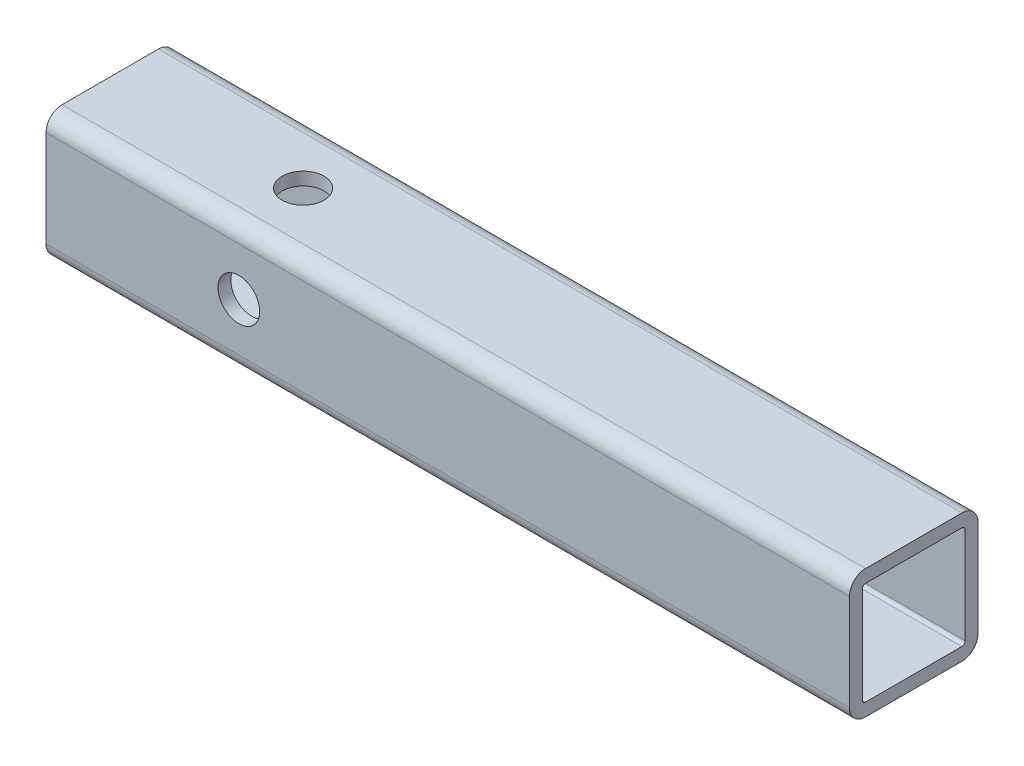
ISO-10303-21;
HEADER;
FILE_DESCRIPTION(('STEP AP214'),'2;1');
FILE_NAME('part.step','',(''),(''),'','','');
FILE_SCHEMA(('AUTOMOTIVE_DESIGN { 1 0 10303 214 1 1 1 1 }'));
ENDSEC;
DATA;
#1=APPLICATION_CONTEXT('core data for automotive mechanical design processes');
#2=APPLICATION_PROTOCOL_DEFINITION('international standard','automotive_design',2000,#1);
#3=PRODUCT_CONTEXT('',#1,'mechanical');
#4=PRODUCT('Part','Part','',(#3));
#5=PRODUCT_RELATED_PRODUCT_CATEGORY('part','',(#4));
#6=PRODUCT_DEFINITION_FORMATION('','',#4);
#7=PRODUCT_DEFINITION_CONTEXT('part definition',#1,'design');
#8=PRODUCT_DEFINITION('design','',#6,#7);
#9=PRODUCT_DEFINITION_SHAPE('','',#8);
#10=(LENGTH_UNIT() NAMED_UNIT(*) SI_UNIT(.MILLI.,.METRE.));
#11=(NAMED_UNIT(*) PLANE_ANGLE_UNIT() SI_UNIT($,.RADIAN.));
#12=(NAMED_UNIT(*) SI_UNIT($,.STERADIAN.) SOLID_ANGLE_UNIT());
#13=UNCERTAINTY_MEASURE_WITH_UNIT(LENGTH_MEASURE(1.E-05),#10,'distance_accuracy_value','');
#14=(GEOMETRIC_REPRESENTATION_CONTEXT(3) GLOBAL_UNCERTAINTY_ASSIGNED_CONTEXT((#13)) GLOBAL_UNIT_ASSIGNED_CONTEXT((#10,
#11,#12)) REPRESENTATION_CONTEXT('',''));
#15=CARTESIAN_POINT('',(0.,0.,0.));
#16=DIRECTION('',(0.,0.,1.));
#17=DIRECTION('',(1.,0.,0.));
#18=AXIS2_PLACEMENT_3D('',#15,#16,#17);
#19=CARTESIAN_POINT('',(250.,-5.,5.));
#20=DIRECTION('',(1.,0.,0.));
#21=DIRECTION('',(0.,0.,-1.));
#22=AXIS2_PLACEMENT_3D('',#19,#20,#21);
#23=PLANE('',#22);
#24=CARTESIAN_POINT('',(250.,-5.,5.));
#25=DIRECTION('',(1.,0.,0.));
#26=DIRECTION('',(0.,0.,-1.));
#27=AXIS2_PLACEMENT_3D('',#24,#25,#26);
#28=CIRCLE('',#27,5.);
#29=CARTESIAN_POINT('',(250.,-5.00000000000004,0.));
#30=VERTEX_POINT('',#29);
#31=CARTESIAN_POINT('',(250.,0.,5.00000000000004));
#32=VERTEX_POINT('',#31);
#33=EDGE_CURVE('E227',#30,#32,#28,.T.);
#34=ORIENTED_EDGE('',*,*,#33,.T.);
#35=DIRECTION('',(0.,0.,1.));
#36=VECTOR('',#35,1.);
#37=CARTESIAN_POINT('',(250.,0.,5.00000000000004));
#38=LINE('',#37,#36);
#39=CARTESIAN_POINT('',(250.,0.,35.));
#40=VERTEX_POINT('',#39);
#41=EDGE_CURVE('E230',#32,#40,#38,.T.);
#42=ORIENTED_EDGE('',*,*,#41,.T.);
#43=CARTESIAN_POINT('',(250.,-5.,35.));
#44=DIRECTION('',(1.,0.,0.));
#45=DIRECTION('',(0.,0.,-1.));
#46=AXIS2_PLACEMENT_3D('',#43,#44,#45);
#47=CIRCLE('',#46,5.);
#48=CARTESIAN_POINT('',(250.,-5.00000000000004,40.));
#49=VERTEX_POINT('',#48);
#50=EDGE_CURVE('E232',#40,#49,#47,.T.);
#51=ORIENTED_EDGE('',*,*,#50,.T.);
#52=DIRECTION('',(0.,-1.,0.));
#53=VECTOR('',#52,1.);
#54=CARTESIAN_POINT('',(250.,-5.00000000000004,40.));
#55=LINE('',#54,#53);
#56=CARTESIAN_POINT('',(250.,-35.,40.));
#57=VERTEX_POINT('',#56);
#58=EDGE_CURVE('E234',#49,#57,#55,.T.);
#59=ORIENTED_EDGE('',*,*,#58,.T.);
#60=CARTESIAN_POINT('',(250.,-35.,35.));
#61=DIRECTION('',(1.,0.,0.));
#62=DIRECTION('',(0.,0.,-1.));
#63=AXIS2_PLACEMENT_3D('',#60,#61,#62);
#64=CIRCLE('',#63,5.);
#65=CARTESIAN_POINT('',(250.,-40.,35.));
#66=VERTEX_POINT('',#65);
#67=EDGE_CURVE('E236',#57,#66,#64,.T.);
#68=ORIENTED_EDGE('',*,*,#67,.T.);
#69=DIRECTION('',(0.,0.,-1.));
#70=VECTOR('',#69,1.);
#71=CARTESIAN_POINT('',(250.,-40.,5.00000000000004));
#72=LINE('',#71,#70);
#73=CARTESIAN_POINT('',(250.,-40.,5.00000000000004));
#74=VERTEX_POINT('',#73);
#75=EDGE_CURVE('E238',#66,#74,#72,.T.);
#76=ORIENTED_EDGE('',*,*,#75,.T.);
#77=CARTESIAN_POINT('',(250.,-35.,5.));
#78=DIRECTION('',(1.,0.,0.));
#79=DIRECTION('',(0.,0.,-1.));
#80=AXIS2_PLACEMENT_3D('',#77,#78,#79);
#81=CIRCLE('',#80,5.);
#82=CARTESIAN_POINT('',(250.,-35.,0.));
#83=VERTEX_POINT('',#82);
#84=EDGE_CURVE('E240',#74,#83,#81,.T.);
#85=ORIENTED_EDGE('',*,*,#84,.T.);
#86=DIRECTION('',(0.,1.,0.));
#87=VECTOR('',#86,1.);
#88=CARTESIAN_POINT('',(250.,-5.00000000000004,0.));
#89=LINE('',#88,#87);
#90=EDGE_CURVE('E242',#83,#30,#89,.T.);
#91=ORIENTED_EDGE('',*,*,#90,.T.);
#92=EDGE_LOOP('',(#34,#42,#51,#59,#68,#76,#85,#91));
#93=FACE_BOUND('',#92,.T.);
#94=DIRECTION('',(0.,0.,1.));
#95=VECTOR('',#94,1.);
#96=CARTESIAN_POINT('',(250.,-4.,5.00000000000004));
#97=LINE('',#96,#95);
#98=CARTESIAN_POINT('',(250.,-4.,5.00000000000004));
#99=VERTEX_POINT('',#98);
#100=CARTESIAN_POINT('',(250.,-4.,35.));
#101=VERTEX_POINT('',#100);
#102=EDGE_CURVE('E185',#99,#101,#97,.T.);
#103=ORIENTED_EDGE('',*,*,#102,.F.);
#104=CARTESIAN_POINT('',(250.,-5.,5.));
#105=DIRECTION('',(1.,0.,0.));
#106=DIRECTION('',(0.,0.,-1.));
#107=AXIS2_PLACEMENT_3D('',#104,#105,#106);
#108=CIRCLE('',#107,0.999999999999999);
#109=CARTESIAN_POINT('',(250.,-5.00000000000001,4.));
#110=VERTEX_POINT('',#109);
#111=EDGE_CURVE('E157',#110,#99,#108,.T.);
#112=ORIENTED_EDGE('',*,*,#111,.F.);
#113=DIRECTION('',(0.,1.,0.));
#114=VECTOR('',#113,1.);
#115=CARTESIAN_POINT('',(250.,-5.00000000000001,4.));
#116=LINE('',#115,#114);
#117=CARTESIAN_POINT('',(250.,-35.,4.));
#118=VERTEX_POINT('',#117);
#119=EDGE_CURVE('E197',#118,#110,#116,.T.);
#120=ORIENTED_EDGE('',*,*,#119,.F.);
#121=CARTESIAN_POINT('',(250.,-35.,5.));
#122=DIRECTION('',(1.,0.,0.));
#123=DIRECTION('',(0.,0.,-1.));
#124=AXIS2_PLACEMENT_3D('',#121,#122,#123);
#125=CIRCLE('',#124,1.);
#126=CARTESIAN_POINT('',(250.,-36.,5.00000000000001));
#127=VERTEX_POINT('',#126);
#128=EDGE_CURVE('E195',#127,#118,#125,.T.);
#129=ORIENTED_EDGE('',*,*,#128,.F.);
#130=DIRECTION('',(0.,0.,-1.));
#131=VECTOR('',#130,1.);
#132=CARTESIAN_POINT('',(250.,-36.,5.00000000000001));
#133=LINE('',#132,#131);
#134=CARTESIAN_POINT('',(250.,-36.,35.));
#135=VERTEX_POINT('',#134);
#136=EDGE_CURVE('E193',#135,#127,#133,.T.);
#137=ORIENTED_EDGE('',*,*,#136,.F.);
#138=CARTESIAN_POINT('',(250.,-35.,35.));
#139=DIRECTION('',(1.,0.,0.));
#140=DIRECTION('',(0.,0.,-1.));
#141=AXIS2_PLACEMENT_3D('',#138,#139,#140);
#142=CIRCLE('',#141,1.);
#143=CARTESIAN_POINT('',(250.,-35.,36.));
#144=VERTEX_POINT('',#143);
#145=EDGE_CURVE('E191',#144,#135,#142,.T.);
#146=ORIENTED_EDGE('',*,*,#145,.F.);
#147=DIRECTION('',(0.,-1.,0.));
#148=VECTOR('',#147,1.);
#149=CARTESIAN_POINT('',(250.,-5.00000000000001,36.));
#150=LINE('',#149,#148);
#151=CARTESIAN_POINT('',(250.,-5.00000000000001,36.));
#152=VERTEX_POINT('',#151);
#153=EDGE_CURVE('E189',#152,#144,#150,.T.);
#154=ORIENTED_EDGE('',*,*,#153,.F.);
#155=CARTESIAN_POINT('',(250.,-5.,35.));
#156=DIRECTION('',(1.,0.,0.));
#157=DIRECTION('',(0.,0.,-1.));
#158=AXIS2_PLACEMENT_3D('',#155,#156,#157);
#159=CIRCLE('',#158,1.);
#160=EDGE_CURVE('E187',#101,#152,#159,.T.);
#161=ORIENTED_EDGE('',*,*,#160,.F.);
#162=EDGE_LOOP('',(#103,#112,#120,#129,#137,#146,#154,#161));
#163=FACE_BOUND('',#162,.T.);
#164=ADVANCED_FACE('F27',(#93,#163),#23,.T.);
#165=CARTESIAN_POINT('',(0.,-5.,5.));
#166=DIRECTION('',(1.,0.,0.));
#167=DIRECTION('',(0.,0.,-1.));
#168=AXIS2_PLACEMENT_3D('',#165,#166,#167);
#169=PLANE('',#168);
#170=CARTESIAN_POINT('',(0.,-5.,5.));
#171=DIRECTION('',(1.,0.,0.));
#172=DIRECTION('',(0.,0.,-1.));
#173=AXIS2_PLACEMENT_3D('',#170,#171,#172);
#174=CIRCLE('',#173,5.);
#175=CARTESIAN_POINT('',(0.,-5.00000000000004,0.));
#176=VERTEX_POINT('',#175);
#177=CARTESIAN_POINT('',(0.,0.,5.00000000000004));
#178=VERTEX_POINT('',#177);
#179=EDGE_CURVE('E158',#176,#178,#174,.T.);
#180=ORIENTED_EDGE('',*,*,#179,.F.);
#181=DIRECTION('',(0.,1.,0.));
#182=VECTOR('',#181,1.);
#183=CARTESIAN_POINT('',(0.,-5.00000000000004,0.));
#184=LINE('',#183,#182);
#185=CARTESIAN_POINT('',(0.,-35.,0.));
#186=VERTEX_POINT('',#185);
#187=EDGE_CURVE('E225',#186,#176,#184,.T.);
#188=ORIENTED_EDGE('',*,*,#187,.F.);
#189=CARTESIAN_POINT('',(0.,-35.,5.));
#190=DIRECTION('',(1.,0.,0.));
#191=DIRECTION('',(0.,0.,-1.));
#192=AXIS2_PLACEMENT_3D('',#189,#190,#191);
#193=CIRCLE('',#192,5.);
#194=CARTESIAN_POINT('',(0.,-40.,5.00000000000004));
#195=VERTEX_POINT('',#194);
#196=EDGE_CURVE('E223',#195,#186,#193,.T.);
#197=ORIENTED_EDGE('',*,*,#196,.F.);
#198=DIRECTION('',(0.,0.,-1.));
#199=VECTOR('',#198,1.);
#200=CARTESIAN_POINT('',(0.,-40.,5.00000000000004));
#201=LINE('',#200,#199);
#202=CARTESIAN_POINT('',(0.,-40.,35.));
#203=VERTEX_POINT('',#202);
#204=EDGE_CURVE('E221',#203,#195,#201,.T.);
#205=ORIENTED_EDGE('',*,*,#204,.F.);
#206=CARTESIAN_POINT('',(0.,-35.,35.));
#207=DIRECTION('',(1.,0.,0.));
#208=DIRECTION('',(0.,0.,-1.));
#209=AXIS2_PLACEMENT_3D('',#206,#207,#208);
#210=CIRCLE('',#209,5.);
#211=CARTESIAN_POINT('',(0.,-35.,40.));
#212=VERTEX_POINT('',#211);
#213=EDGE_CURVE('E219',#212,#203,#210,.T.);
#214=ORIENTED_EDGE('',*,*,#213,.F.);
#215=DIRECTION('',(0.,-1.,0.));
#216=VECTOR('',#215,1.);
#217=CARTESIAN_POINT('',(0.,-5.00000000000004,40.));
#218=LINE('',#217,#216);
#219=CARTESIAN_POINT('',(0.,-5.00000000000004,40.));
#220=VERTEX_POINT('',#219);
#221=EDGE_CURVE('E217',#220,#212,#218,.T.);
#222=ORIENTED_EDGE('',*,*,#221,.F.);
#223=CARTESIAN_POINT('',(0.,-5.,35.));
#224=DIRECTION('',(1.,0.,0.));
#225=DIRECTION('',(0.,0.,-1.));
#226=AXIS2_PLACEMENT_3D('',#223,#224,#225);
#227=CIRCLE('',#226,5.);
#228=CARTESIAN_POINT('',(0.,0.,35.));
#229=VERTEX_POINT('',#228);
#230=EDGE_CURVE('E215',#229,#220,#227,.T.);
#231=ORIENTED_EDGE('',*,*,#230,.F.);
#232=DIRECTION('',(0.,0.,1.));
#233=VECTOR('',#232,1.);
#234=CARTESIAN_POINT('',(0.,0.,5.00000000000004));
#235=LINE('',#234,#233);
#236=EDGE_CURVE('E213',#178,#229,#235,.T.);
#237=ORIENTED_EDGE('',*,*,#236,.F.);
#238=EDGE_LOOP('',(#180,#188,#197,#205,#214,#222,#231,#237));
#239=FACE_BOUND('',#238,.T.);
#240=CARTESIAN_POINT('',(0.,-5.,5.));
#241=DIRECTION('',(1.,0.,0.));
#242=DIRECTION('',(0.,0.,-1.));
#243=AXIS2_PLACEMENT_3D('',#240,#241,#242);
#244=CIRCLE('',#243,0.999999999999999);
#245=CARTESIAN_POINT('',(0.,-5.00000000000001,4.));
#246=VERTEX_POINT('',#245);
#247=CARTESIAN_POINT('',(0.,-4.,5.00000000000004));
#248=VERTEX_POINT('',#247);
#249=EDGE_CURVE('E52',#246,#248,#244,.T.);
#250=ORIENTED_EDGE('',*,*,#249,.T.);
#251=DIRECTION('',(0.,0.,1.));
#252=VECTOR('',#251,1.);
#253=CARTESIAN_POINT('',(0.,-4.,5.00000000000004));
#254=LINE('',#253,#252);
#255=CARTESIAN_POINT('',(0.,-4.,35.));
#256=VERTEX_POINT('',#255);
#257=EDGE_CURVE('E144',#248,#256,#254,.T.);
#258=ORIENTED_EDGE('',*,*,#257,.T.);
#259=CARTESIAN_POINT('',(0.,-5.,35.));
#260=DIRECTION('',(1.,0.,0.));
#261=DIRECTION('',(0.,0.,-1.));
#262=AXIS2_PLACEMENT_3D('',#259,#260,#261);
#263=CIRCLE('',#262,1.);
#264=CARTESIAN_POINT('',(0.,-5.00000000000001,36.));
#265=VERTEX_POINT('',#264);
#266=EDGE_CURVE('E153',#256,#265,#263,.T.);
#267=ORIENTED_EDGE('',*,*,#266,.T.);
#268=DIRECTION('',(0.,-1.,0.));
#269=VECTOR('',#268,1.);
#270=CARTESIAN_POINT('',(0.,-5.00000000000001,36.));
#271=LINE('',#270,#269);
#272=CARTESIAN_POINT('',(0.,-35.,36.));
#273=VERTEX_POINT('',#272);
#274=EDGE_CURVE('E172',#265,#273,#271,.T.);
#275=ORIENTED_EDGE('',*,*,#274,.T.);
#276=CARTESIAN_POINT('',(0.,-35.,35.));
#277=DIRECTION('',(1.,0.,0.));
#278=DIRECTION('',(0.,0.,-1.));
#279=AXIS2_PLACEMENT_3D('',#276,#277,#278);
#280=CIRCLE('',#279,1.);
#281=CARTESIAN_POINT('',(0.,-36.,35.));
#282=VERTEX_POINT('',#281);
#283=EDGE_CURVE('E175',#273,#282,#280,.T.);
#284=ORIENTED_EDGE('',*,*,#283,.T.);
#285=DIRECTION('',(0.,0.,-1.));
#286=VECTOR('',#285,1.);
#287=CARTESIAN_POINT('',(0.,-36.,5.00000000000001));
#288=LINE('',#287,#286);
#289=CARTESIAN_POINT('',(0.,-36.,5.00000000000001));
#290=VERTEX_POINT('',#289);
#291=EDGE_CURVE('E178',#282,#290,#288,.T.);
#292=ORIENTED_EDGE('',*,*,#291,.T.);
#293=CARTESIAN_POINT('',(0.,-35.,5.));
#294=DIRECTION('',(1.,0.,0.));
#295=DIRECTION('',(0.,0.,-1.));
#296=AXIS2_PLACEMENT_3D('',#293,#294,#295);
#297=CIRCLE('',#296,1.);
#298=CARTESIAN_POINT('',(0.,-35.,4.));
#299=VERTEX_POINT('',#298);
#300=EDGE_CURVE('E181',#290,#299,#297,.T.);
#301=ORIENTED_EDGE('',*,*,#300,.T.);
#302=DIRECTION('',(0.,1.,0.));
#303=VECTOR('',#302,1.);
#304=CARTESIAN_POINT('',(0.,-5.00000000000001,4.));
#305=LINE('',#304,#303);
#306=EDGE_CURVE('E163',#299,#246,#305,.T.);
#307=ORIENTED_EDGE('',*,*,#306,.T.);
#308=EDGE_LOOP('',(#250,#258,#267,#275,#284,#292,#301,#307));
#309=FACE_BOUND('',#308,.T.);
#310=ADVANCED_FACE('F161',(#239,#309),#169,.F.);
#311=CARTESIAN_POINT('',(250.,-5.,5.));
#312=DIRECTION('',(-1.,0.,0.));
#313=DIRECTION('',(0.,0.,1.));
#314=AXIS2_PLACEMENT_3D('',#311,#312,#313);
#315=CYLINDRICAL_SURFACE('',#314,5.);
#316=ORIENTED_EDGE('',*,*,#179,.T.);
#317=DIRECTION('',(-1.,0.,0.));
#318=VECTOR('',#317,1.);
#319=CARTESIAN_POINT('',(250.,0.,5.00000000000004));
#320=LINE('',#319,#318);
#321=EDGE_CURVE('E11',#32,#178,#320,.T.);
#322=ORIENTED_EDGE('',*,*,#321,.F.);
#323=ORIENTED_EDGE('',*,*,#33,.F.);
#324=DIRECTION('',(-1.,0.,0.));
#325=VECTOR('',#324,1.);
#326=CARTESIAN_POINT('',(250.,-5.00000000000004,0.));
#327=LINE('',#326,#325);
#328=EDGE_CURVE('E244',#30,#176,#327,.T.);
#329=ORIENTED_EDGE('',*,*,#328,.T.);
#330=EDGE_LOOP('',(#316,#322,#323,#329));
#331=FACE_BOUND('',#330,.T.);
#332=ADVANCED_FACE('F29',(#331),#315,.T.);
#333=CARTESIAN_POINT('',(250.,0.,5.00000000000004));
#334=DIRECTION('',(0.,-1.,0.));
#335=DIRECTION('',(0.,0.,-1.));
#336=AXIS2_PLACEMENT_3D('',#333,#334,#335);
#337=PLANE('',#336);
#338=CARTESIAN_POINT('',(60.,0.,20.));
#339=DIRECTION('',(0.,-1.,0.));
#340=DIRECTION('',(0.,0.,-1.));
#341=AXIS2_PLACEMENT_3D('',#338,#339,#340);
#342=CIRCLE('',#341,6.5);
#343=CARTESIAN_POINT('',(60.,0.,13.5));
#344=VERTEX_POINT('',#343);
#345=EDGE_CURVE('E277',#344,#344,#342,.T.);
#346=ORIENTED_EDGE('',*,*,#345,.T.);
#347=EDGE_LOOP('',(#346));
#348=FACE_BOUND('',#347,.T.);
#349=ORIENTED_EDGE('',*,*,#236,.T.);
#350=DIRECTION('',(-1.,0.,0.));
#351=VECTOR('',#350,1.);
#352=CARTESIAN_POINT('',(250.,0.,35.));
#353=LINE('',#352,#351);
#354=EDGE_CURVE('E36',#40,#229,#353,.T.);
#355=ORIENTED_EDGE('',*,*,#354,.F.);
#356=ORIENTED_EDGE('',*,*,#41,.F.);
#357=ORIENTED_EDGE('',*,*,#321,.T.);
#358=EDGE_LOOP('',(#349,#355,#356,#357));
#359=FACE_BOUND('',#358,.T.);
#360=ADVANCED_FACE('F327',(#348,#359),#337,.F.);
#361=CARTESIAN_POINT('',(250.,-5.,35.));
#362=DIRECTION('',(-1.,0.,0.));
#363=DIRECTION('',(0.,0.,1.));
#364=AXIS2_PLACEMENT_3D('',#361,#362,#363);
#365=CYLINDRICAL_SURFACE('',#364,5.);
#366=ORIENTED_EDGE('',*,*,#230,.T.);
#367=DIRECTION('',(-1.,0.,0.));
#368=VECTOR('',#367,1.);
#369=CARTESIAN_POINT('',(250.,-5.00000000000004,40.));
#370=LINE('',#369,#368);
#371=EDGE_CURVE('E259',#49,#220,#370,.T.);
#372=ORIENTED_EDGE('',*,*,#371,.F.);
#373=ORIENTED_EDGE('',*,*,#50,.F.);
#374=ORIENTED_EDGE('',*,*,#354,.T.);
#375=EDGE_LOOP('',(#366,#372,#373,#374));
#376=FACE_BOUND('',#375,.T.);
#377=ADVANCED_FACE('F325',(#376),#365,.T.);
#378=CARTESIAN_POINT('',(250.,-5.00000000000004,40.));
#379=DIRECTION('',(0.,0.,-1.));
#380=DIRECTION('',(-1.,0.,0.));
#381=AXIS2_PLACEMENT_3D('',#378,#379,#380);
#382=PLANE('',#381);
#383=CARTESIAN_POINT('',(60.,-20.,40.));
#384=DIRECTION('',(0.,0.,1.));
#385=DIRECTION('',(1.,0.,0.));
#386=AXIS2_PLACEMENT_3D('',#383,#384,#385);
#387=CIRCLE('',#386,6.5);
#388=CARTESIAN_POINT('',(66.5,-20.,40.));
#389=VERTEX_POINT('',#388);
#390=EDGE_CURVE('E268',#389,#389,#387,.T.);
#391=ORIENTED_EDGE('',*,*,#390,.F.);
#392=EDGE_LOOP('',(#391));
#393=FACE_BOUND('',#392,.T.);
#394=ORIENTED_EDGE('',*,*,#221,.T.);
#395=DIRECTION('',(-1.,0.,0.));
#396=VECTOR('',#395,1.);
#397=CARTESIAN_POINT('',(250.,-35.,40.));
#398=LINE('',#397,#396);
#399=EDGE_CURVE('E256',#57,#212,#398,.T.);
#400=ORIENTED_EDGE('',*,*,#399,.F.);
#401=ORIENTED_EDGE('',*,*,#58,.F.);
#402=ORIENTED_EDGE('',*,*,#371,.T.);
#403=EDGE_LOOP('',(#394,#400,#401,#402));
#404=FACE_BOUND('',#403,.T.);
#405=ADVANCED_FACE('F321',(#393,#404),#382,.F.);
#406=CARTESIAN_POINT('',(250.,-35.,35.));
#407=DIRECTION('',(-1.,0.,0.));
#408=DIRECTION('',(0.,0.,1.));
#409=AXIS2_PLACEMENT_3D('',#406,#407,#408);
#410=CYLINDRICAL_SURFACE('',#409,5.);
#411=ORIENTED_EDGE('',*,*,#213,.T.);
#412=DIRECTION('',(-1.,0.,0.));
#413=VECTOR('',#412,1.);
#414=CARTESIAN_POINT('',(250.,-40.,35.));
#415=LINE('',#414,#413);
#416=EDGE_CURVE('E253',#66,#203,#415,.T.);
#417=ORIENTED_EDGE('',*,*,#416,.F.);
#418=ORIENTED_EDGE('',*,*,#67,.F.);
#419=ORIENTED_EDGE('',*,*,#399,.T.);
#420=EDGE_LOOP('',(#411,#417,#418,#419));
#421=FACE_BOUND('',#420,.T.);
#422=ADVANCED_FACE('F290',(#421),#410,.T.);
#423=CARTESIAN_POINT('',(250.,-40.,5.00000000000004));
#424=DIRECTION('',(0.,1.,0.));
#425=DIRECTION('',(0.,0.,1.));
#426=AXIS2_PLACEMENT_3D('',#423,#424,#425);
#427=PLANE('',#426);
#428=CARTESIAN_POINT('',(60.,-40.,20.));
#429=DIRECTION('',(0.,-1.,0.));
#430=DIRECTION('',(0.,0.,-1.));
#431=AXIS2_PLACEMENT_3D('',#428,#429,#430);
#432=CIRCLE('',#431,6.5);
#433=CARTESIAN_POINT('',(60.,-40.,13.5));
#434=VERTEX_POINT('',#433);
#435=EDGE_CURVE('E280',#434,#434,#432,.T.);
#436=ORIENTED_EDGE('',*,*,#435,.F.);
#437=EDGE_LOOP('',(#436));
#438=FACE_BOUND('',#437,.T.);
#439=ORIENTED_EDGE('',*,*,#204,.T.);
#440=DIRECTION('',(-1.,0.,0.));
#441=VECTOR('',#440,1.);
#442=CARTESIAN_POINT('',(250.,-40.,5.00000000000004));
#443=LINE('',#442,#441);
#444=EDGE_CURVE('E250',#74,#195,#443,.T.);
#445=ORIENTED_EDGE('',*,*,#444,.F.);
#446=ORIENTED_EDGE('',*,*,#75,.F.);
#447=ORIENTED_EDGE('',*,*,#416,.T.);
#448=EDGE_LOOP('',(#439,#445,#446,#447));
#449=FACE_BOUND('',#448,.T.);
#450=ADVANCED_FACE('F286',(#438,#449),#427,.F.);
#451=CARTESIAN_POINT('',(250.,-35.,5.));
#452=DIRECTION('',(-1.,0.,0.));
#453=DIRECTION('',(0.,0.,1.));
#454=AXIS2_PLACEMENT_3D('',#451,#452,#453);
#455=CYLINDRICAL_SURFACE('',#454,5.);
#456=ORIENTED_EDGE('',*,*,#196,.T.);
#457=DIRECTION('',(-1.,0.,0.));
#458=VECTOR('',#457,1.);
#459=CARTESIAN_POINT('',(250.,-35.,0.));
#460=LINE('',#459,#458);
#461=EDGE_CURVE('E247',#83,#186,#460,.T.);
#462=ORIENTED_EDGE('',*,*,#461,.F.);
#463=ORIENTED_EDGE('',*,*,#84,.F.);
#464=ORIENTED_EDGE('',*,*,#444,.T.);
#465=EDGE_LOOP('',(#456,#462,#463,#464));
#466=FACE_BOUND('',#465,.T.);
#467=ADVANCED_FACE('F289',(#466),#455,.T.);
#468=CARTESIAN_POINT('',(250.,-5.00000000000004,0.));
#469=DIRECTION('',(0.,0.,1.));
#470=DIRECTION('',(1.,0.,0.));
#471=AXIS2_PLACEMENT_3D('',#468,#469,#470);
#472=PLANE('',#471);
#473=CARTESIAN_POINT('',(60.,-20.,0.));
#474=DIRECTION('',(0.,0.,1.));
#475=DIRECTION('',(1.,0.,0.));
#476=AXIS2_PLACEMENT_3D('',#473,#474,#475);
#477=CIRCLE('',#476,6.5);
#478=CARTESIAN_POINT('',(66.5,-20.,0.));
#479=VERTEX_POINT('',#478);
#480=EDGE_CURVE('E264',#479,#479,#477,.T.);
#481=ORIENTED_EDGE('',*,*,#480,.T.);
#482=EDGE_LOOP('',(#481));
#483=FACE_BOUND('',#482,.T.);
#484=ORIENTED_EDGE('',*,*,#187,.T.);
#485=ORIENTED_EDGE('',*,*,#328,.F.);
#486=ORIENTED_EDGE('',*,*,#90,.F.);
#487=ORIENTED_EDGE('',*,*,#461,.T.);
#488=EDGE_LOOP('',(#484,#485,#486,#487));
#489=FACE_BOUND('',#488,.T.);
#490=ADVANCED_FACE('F306',(#483,#489),#472,.F.);
#491=CARTESIAN_POINT('',(250.,-5.,5.));
#492=DIRECTION('',(-1.,0.,0.));
#493=DIRECTION('',(0.,0.,1.));
#494=AXIS2_PLACEMENT_3D('',#491,#492,#493);
#495=CYLINDRICAL_SURFACE('',#494,0.999999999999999);
#496=ORIENTED_EDGE('',*,*,#249,.F.);
#497=DIRECTION('',(-1.,0.,0.));
#498=VECTOR('',#497,1.);
#499=CARTESIAN_POINT('',(250.,-5.00000000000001,4.));
#500=LINE('',#499,#498);
#501=EDGE_CURVE('E199',#110,#246,#500,.T.);
#502=ORIENTED_EDGE('',*,*,#501,.F.);
#503=ORIENTED_EDGE('',*,*,#111,.T.);
#504=DIRECTION('',(-1.,0.,0.));
#505=VECTOR('',#504,1.);
#506=CARTESIAN_POINT('',(250.,-4.,5.00000000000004));
#507=LINE('',#506,#505);
#508=EDGE_CURVE('E146',#99,#248,#507,.T.);
#509=ORIENTED_EDGE('',*,*,#508,.T.);
#510=EDGE_LOOP('',(#496,#502,#503,#509));
#511=FACE_BOUND('',#510,.T.);
#512=ADVANCED_FACE('F155',(#511),#495,.F.);
#513=CARTESIAN_POINT('',(250.,-4.,5.00000000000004));
#514=DIRECTION('',(0.,-1.,0.));
#515=DIRECTION('',(0.,0.,-1.));
#516=AXIS2_PLACEMENT_3D('',#513,#514,#515);
#517=PLANE('',#516);
#518=CARTESIAN_POINT('',(60.,-4.,20.));
#519=DIRECTION('',(0.,-1.,0.));
#520=DIRECTION('',(0.,0.,-1.));
#521=AXIS2_PLACEMENT_3D('',#518,#519,#520);
#522=CIRCLE('',#521,6.5);
#523=CARTESIAN_POINT('',(60.,-4.,13.5));
#524=VERTEX_POINT('',#523);
#525=EDGE_CURVE('E272',#524,#524,#522,.T.);
#526=ORIENTED_EDGE('',*,*,#525,.F.);
#527=EDGE_LOOP('',(#526));
#528=FACE_BOUND('',#527,.T.);
#529=ORIENTED_EDGE('',*,*,#257,.F.);
#530=ORIENTED_EDGE('',*,*,#508,.F.);
#531=ORIENTED_EDGE('',*,*,#102,.T.);
#532=DIRECTION('',(-1.,0.,0.));
#533=VECTOR('',#532,1.);
#534=CARTESIAN_POINT('',(250.,-4.,35.));
#535=LINE('',#534,#533);
#536=EDGE_CURVE('E149',#101,#256,#535,.T.);
#537=ORIENTED_EDGE('',*,*,#536,.T.);
#538=EDGE_LOOP('',(#529,#530,#531,#537));
#539=FACE_BOUND('',#538,.T.);
#540=ADVANCED_FACE('F145',(#528,#539),#517,.T.);
#541=CARTESIAN_POINT('',(250.,-5.,35.));
#542=DIRECTION('',(-1.,0.,0.));
#543=DIRECTION('',(0.,0.,1.));
#544=AXIS2_PLACEMENT_3D('',#541,#542,#543);
#545=CYLINDRICAL_SURFACE('',#544,1.);
#546=ORIENTED_EDGE('',*,*,#266,.F.);
#547=ORIENTED_EDGE('',*,*,#536,.F.);
#548=ORIENTED_EDGE('',*,*,#160,.T.);
#549=DIRECTION('',(-1.,0.,0.));
#550=VECTOR('',#549,1.);
#551=CARTESIAN_POINT('',(250.,-5.00000000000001,36.));
#552=LINE('',#551,#550);
#553=EDGE_CURVE('E208',#152,#265,#552,.T.);
#554=ORIENTED_EDGE('',*,*,#553,.T.);
#555=EDGE_LOOP('',(#546,#547,#548,#554));
#556=FACE_BOUND('',#555,.T.);
#557=ADVANCED_FACE('F387',(#556),#545,.F.);
#558=CARTESIAN_POINT('',(250.,-5.00000000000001,36.));
#559=DIRECTION('',(0.,0.,-1.));
#560=DIRECTION('',(-1.,0.,0.));
#561=AXIS2_PLACEMENT_3D('',#558,#559,#560);
#562=PLANE('',#561);
#563=CARTESIAN_POINT('',(60.,-20.,36.));
#564=DIRECTION('',(0.,0.,-1.));
#565=DIRECTION('',(-1.,0.,0.));
#566=AXIS2_PLACEMENT_3D('',#563,#564,#565);
#567=CIRCLE('',#566,6.5);
#568=CARTESIAN_POINT('',(53.5,-20.,36.));
#569=VERTEX_POINT('',#568);
#570=EDGE_CURVE('E164',#569,#569,#567,.T.);
#571=ORIENTED_EDGE('',*,*,#570,.F.);
#572=EDGE_LOOP('',(#571));
#573=FACE_BOUND('',#572,.T.);
#574=ORIENTED_EDGE('',*,*,#274,.F.);
#575=ORIENTED_EDGE('',*,*,#553,.F.);
#576=ORIENTED_EDGE('',*,*,#153,.T.);
#577=DIRECTION('',(-1.,0.,0.));
#578=VECTOR('',#577,1.);
#579=CARTESIAN_POINT('',(250.,-35.,36.));
#580=LINE('',#579,#578);
#581=EDGE_CURVE('E206',#144,#273,#580,.T.);
#582=ORIENTED_EDGE('',*,*,#581,.T.);
#583=EDGE_LOOP('',(#574,#575,#576,#582));
#584=FACE_BOUND('',#583,.T.);
#585=ADVANCED_FACE('F383',(#573,#584),#562,.T.);
#586=CARTESIAN_POINT('',(250.,-35.,35.));
#587=DIRECTION('',(-1.,0.,0.));
#588=DIRECTION('',(0.,0.,1.));
#589=AXIS2_PLACEMENT_3D('',#586,#587,#588);
#590=CYLINDRICAL_SURFACE('',#589,1.);
#591=ORIENTED_EDGE('',*,*,#283,.F.);
#592=ORIENTED_EDGE('',*,*,#581,.F.);
#593=ORIENTED_EDGE('',*,*,#145,.T.);
#594=DIRECTION('',(-1.,0.,0.));
#595=VECTOR('',#594,1.);
#596=CARTESIAN_POINT('',(250.,-36.,35.));
#597=LINE('',#596,#595);
#598=EDGE_CURVE('E204',#135,#282,#597,.T.);
#599=ORIENTED_EDGE('',*,*,#598,.T.);
#600=EDGE_LOOP('',(#591,#592,#593,#599));
#601=FACE_BOUND('',#600,.T.);
#602=ADVANCED_FACE('F379',(#601),#590,.F.);
#603=CARTESIAN_POINT('',(250.,-36.,5.00000000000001));
#604=DIRECTION('',(0.,1.,0.));
#605=DIRECTION('',(0.,0.,1.));
#606=AXIS2_PLACEMENT_3D('',#603,#604,#605);
#607=PLANE('',#606);
#608=CARTESIAN_POINT('',(60.,-36.,20.));
#609=DIRECTION('',(0.,1.,0.));
#610=DIRECTION('',(0.,0.,1.));
#611=AXIS2_PLACEMENT_3D('',#608,#609,#610);
#612=CIRCLE('',#611,6.5);
#613=CARTESIAN_POINT('',(60.,-36.,26.5));
#614=VERTEX_POINT('',#613);
#615=EDGE_CURVE('E31',#614,#614,#612,.T.);
#616=ORIENTED_EDGE('',*,*,#615,.F.);
#617=EDGE_LOOP('',(#616));
#618=FACE_BOUND('',#617,.T.);
#619=ORIENTED_EDGE('',*,*,#291,.F.);
#620=ORIENTED_EDGE('',*,*,#598,.F.);
#621=ORIENTED_EDGE('',*,*,#136,.T.);
#622=DIRECTION('',(-1.,0.,0.));
#623=VECTOR('',#622,1.);
#624=CARTESIAN_POINT('',(250.,-36.,5.00000000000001));
#625=LINE('',#624,#623);
#626=EDGE_CURVE('E202',#127,#290,#625,.T.);
#627=ORIENTED_EDGE('',*,*,#626,.T.);
#628=EDGE_LOOP('',(#619,#620,#621,#627));
#629=FACE_BOUND('',#628,.T.);
#630=ADVANCED_FACE('F375',(#618,#629),#607,.T.);
#631=CARTESIAN_POINT('',(250.,-35.,5.));
#632=DIRECTION('',(-1.,0.,0.));
#633=DIRECTION('',(0.,0.,1.));
#634=AXIS2_PLACEMENT_3D('',#631,#632,#633);
#635=CYLINDRICAL_SURFACE('',#634,1.);
#636=ORIENTED_EDGE('',*,*,#300,.F.);
#637=ORIENTED_EDGE('',*,*,#626,.F.);
#638=ORIENTED_EDGE('',*,*,#128,.T.);
#639=DIRECTION('',(-1.,0.,0.));
#640=VECTOR('',#639,1.);
#641=CARTESIAN_POINT('',(250.,-35.,4.));
#642=LINE('',#641,#640);
#643=EDGE_CURVE('E44',#118,#299,#642,.T.);
#644=ORIENTED_EDGE('',*,*,#643,.T.);
#645=EDGE_LOOP('',(#636,#637,#638,#644));
#646=FACE_BOUND('',#645,.T.);
#647=ADVANCED_FACE('F371',(#646),#635,.F.);
#648=CARTESIAN_POINT('',(250.,-5.00000000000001,4.));
#649=DIRECTION('',(0.,0.,1.));
#650=DIRECTION('',(1.,0.,0.));
#651=AXIS2_PLACEMENT_3D('',#648,#649,#650);
#652=PLANE('',#651);
#653=CARTESIAN_POINT('',(60.,-20.,4.));
#654=DIRECTION('',(0.,0.,1.));
#655=DIRECTION('',(1.,0.,0.));
#656=AXIS2_PLACEMENT_3D('',#653,#654,#655);
#657=CIRCLE('',#656,6.5);
#658=CARTESIAN_POINT('',(66.5,-20.,4.));
#659=VERTEX_POINT('',#658);
#660=EDGE_CURVE('E167',#659,#659,#657,.T.);
#661=ORIENTED_EDGE('',*,*,#660,.F.);
#662=EDGE_LOOP('',(#661));
#663=FACE_BOUND('',#662,.T.);
#664=ORIENTED_EDGE('',*,*,#306,.F.);
#665=ORIENTED_EDGE('',*,*,#643,.F.);
#666=ORIENTED_EDGE('',*,*,#119,.T.);
#667=ORIENTED_EDGE('',*,*,#501,.T.);
#668=EDGE_LOOP('',(#664,#665,#666,#667));
#669=FACE_BOUND('',#668,.T.);
#670=ADVANCED_FACE('F367',(#663,#669),#652,.T.);
#671=CARTESIAN_POINT('',(60.,-20.,0.));
#672=DIRECTION('',(0.,0.,1.));
#673=DIRECTION('',(1.,0.,0.));
#674=AXIS2_PLACEMENT_3D('',#671,#672,#673);
#675=CYLINDRICAL_SURFACE('',#674,6.5);
#676=ORIENTED_EDGE('',*,*,#660,.T.);
#677=EDGE_LOOP('',(#676));
#678=FACE_BOUND('',#677,.T.);
#679=ORIENTED_EDGE('',*,*,#480,.F.);
#680=EDGE_LOOP('',(#679));
#681=FACE_BOUND('',#680,.T.);
#682=ADVANCED_FACE('F357',(#678,#681),#675,.F.);
#683=ORIENTED_EDGE('',*,*,#570,.T.);
#684=EDGE_LOOP('',(#683));
#685=FACE_BOUND('',#684,.T.);
#686=ORIENTED_EDGE('',*,*,#390,.T.);
#687=EDGE_LOOP('',(#686));
#688=FACE_BOUND('',#687,.T.);
#689=ADVANCED_FACE('F355',(#685,#688),#675,.F.);
#690=CARTESIAN_POINT('',(60.,0.,20.));
#691=DIRECTION('',(0.,-1.,0.));
#692=DIRECTION('',(0.,0.,-1.));
#693=AXIS2_PLACEMENT_3D('',#690,#691,#692);
#694=CYLINDRICAL_SURFACE('',#693,6.5);
#695=ORIENTED_EDGE('',*,*,#615,.T.);
#696=EDGE_LOOP('',(#695));
#697=FACE_BOUND('',#696,.T.);
#698=ORIENTED_EDGE('',*,*,#435,.T.);
#699=EDGE_LOOP('',(#698));
#700=FACE_BOUND('',#699,.T.);
#701=ADVANCED_FACE('F284',(#697,#700),#694,.F.);
#702=ORIENTED_EDGE('',*,*,#525,.T.);
#703=EDGE_LOOP('',(#702));
#704=FACE_BOUND('',#703,.T.);
#705=ORIENTED_EDGE('',*,*,#345,.F.);
#706=EDGE_LOOP('',(#705));
#707=FACE_BOUND('',#706,.T.);
#708=ADVANCED_FACE('F364',(#704,#707),#694,.F.);
#709=CLOSED_SHELL('',(#164,#310,#332,#360,#377,#405,#422,#450,#467,#490,#512,#540,#557,#585,
#602,#630,#647,#670,#682,#689,#701,#708));
#710=MANIFOLD_SOLID_BREP('B2',#709);
#711=ADVANCED_BREP_SHAPE_REPRESENTATION('',(#18,#710),#14);
#712=SHAPE_DEFINITION_REPRESENTATION(#9,#711);
ENDSEC;
END-ISO-10303-21;
